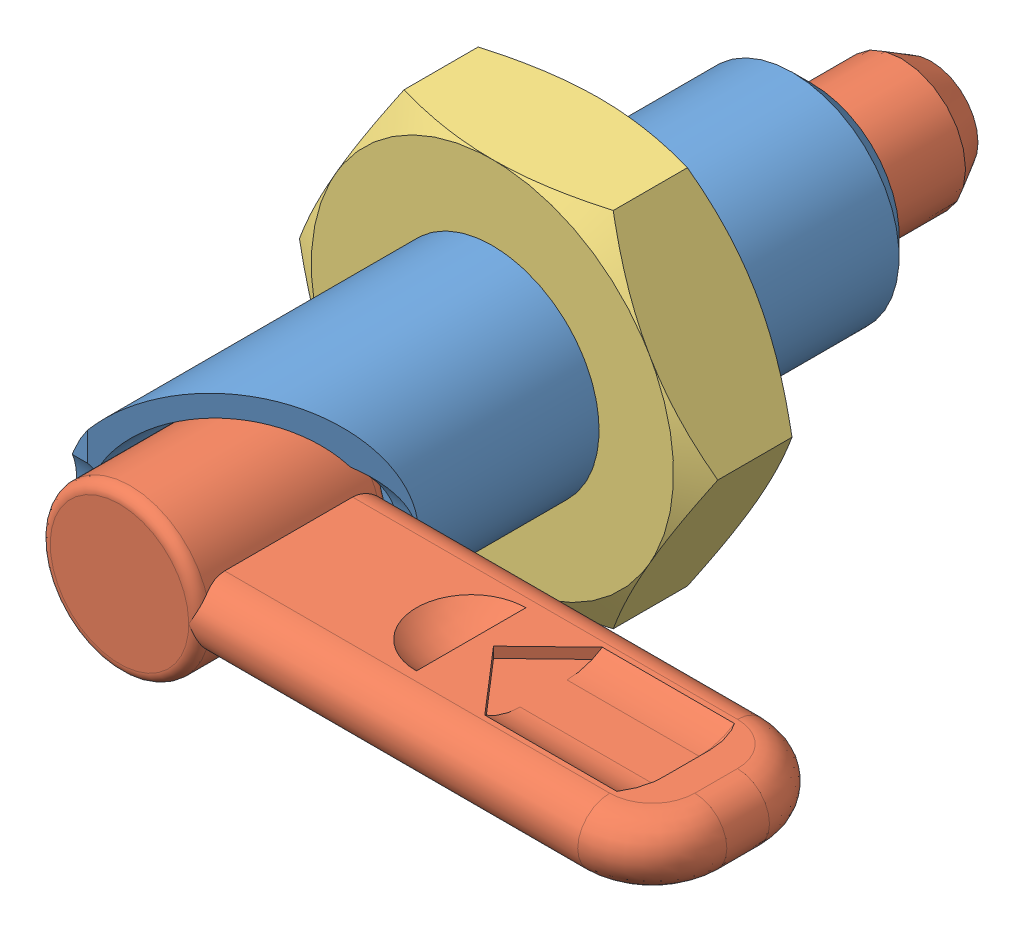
SolidWorks assembly GDX10LW-6N-SUS.sldasm, configuration Default (file format 15000). Lengths in mm.
Overall size (36.62 23.23 38.5).
3 component instances, 3 part files, 0 mates.
Components (placement in the parent):
- GDX10LW-6N-SUS_01-1: GDX10LW-6N-SUS_01.SLDPRT [ﾃﾞﾌｫﾙﾄ] x (1 0 0) z (0 -1 0) size (10.01 31.09 10.01)
- GDX10LW-6N-SUS_02-1: GDX10LW-6N-SUS_02.SLDPRT [ﾃﾞﾌｫﾙﾄ] x (1 0 0) z (0 -1 0) size (28.75 38.5 7.5)
- GDX10LW-6N-SUS_03-1: GDX10LW-6N-SUS_03.SLDPRT [ﾃﾞﾌｫﾙﾄ] at (0 0 10) x (0 0 1) z (0 1 0) size (5.01 23.23 23.23)
